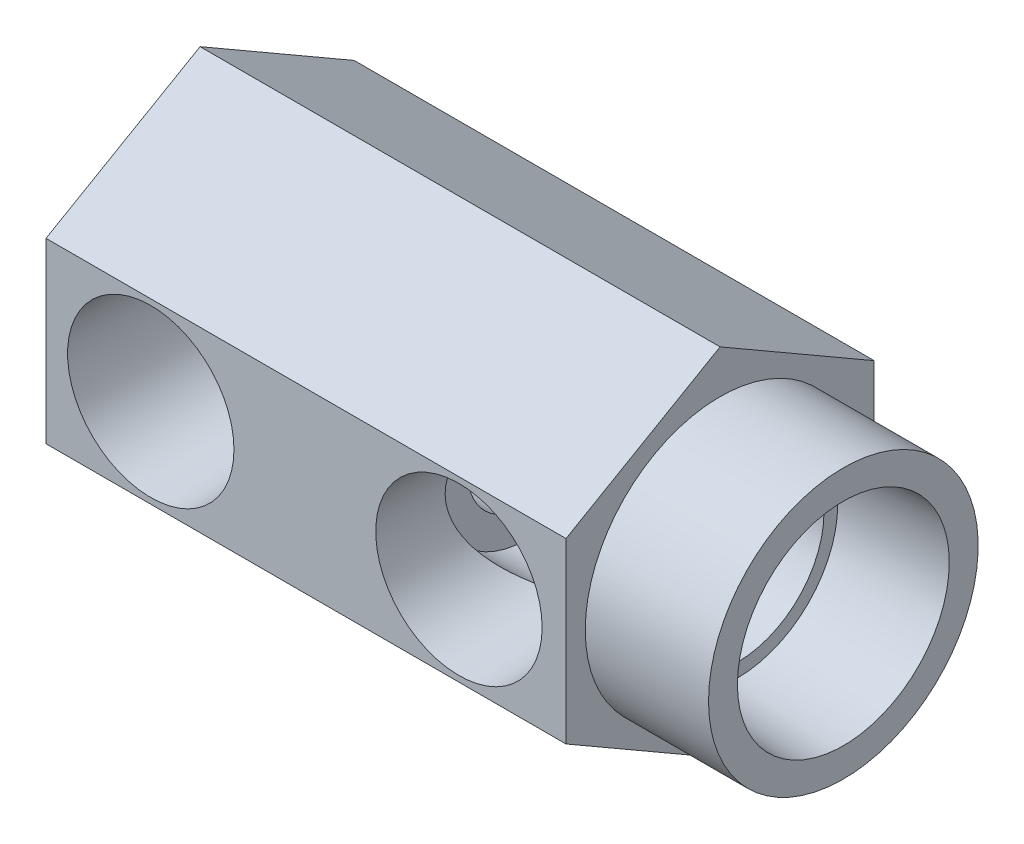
ISO-10303-21;
HEADER;
FILE_DESCRIPTION(('STEP AP214'),'2;1');
FILE_NAME('part.step','',(''),(''),'','','');
FILE_SCHEMA(('AUTOMOTIVE_DESIGN { 1 0 10303 214 1 1 1 1 }'));
ENDSEC;
DATA;
#1=APPLICATION_CONTEXT('core data for automotive mechanical design processes');
#2=APPLICATION_PROTOCOL_DEFINITION('international standard','automotive_design',2000,#1);
#3=PRODUCT_CONTEXT('',#1,'mechanical');
#4=PRODUCT('Part','Part','',(#3));
#5=PRODUCT_RELATED_PRODUCT_CATEGORY('part','',(#4));
#6=PRODUCT_DEFINITION_FORMATION('','',#4);
#7=PRODUCT_DEFINITION_CONTEXT('part definition',#1,'design');
#8=PRODUCT_DEFINITION('design','',#6,#7);
#9=PRODUCT_DEFINITION_SHAPE('','',#8);
#10=(LENGTH_UNIT() NAMED_UNIT(*) SI_UNIT(.MILLI.,.METRE.));
#11=(NAMED_UNIT(*) PLANE_ANGLE_UNIT() SI_UNIT($,.RADIAN.));
#12=(NAMED_UNIT(*) SI_UNIT($,.STERADIAN.) SOLID_ANGLE_UNIT());
#13=UNCERTAINTY_MEASURE_WITH_UNIT(LENGTH_MEASURE(1.E-05),#10,'distance_accuracy_value','');
#14=(GEOMETRIC_REPRESENTATION_CONTEXT(3) GLOBAL_UNCERTAINTY_ASSIGNED_CONTEXT((#13)) GLOBAL_UNIT_ASSIGNED_CONTEXT((#10,
#11,#12)) REPRESENTATION_CONTEXT('',''));
#15=CARTESIAN_POINT('',(0.,0.,0.));
#16=DIRECTION('',(0.,0.,1.));
#17=DIRECTION('',(1.,0.,0.));
#18=AXIS2_PLACEMENT_3D('',#15,#16,#17);
#19=CARTESIAN_POINT('',(53.0225,0.,0.));
#20=DIRECTION('',(-1.,0.,0.));
#21=DIRECTION('',(0.,0.,1.));
#22=AXIS2_PLACEMENT_3D('',#19,#20,#21);
#23=PLANE('',#22);
#24=CARTESIAN_POINT('',(53.0225,0.,0.));
#25=DIRECTION('',(-1.,0.,0.));
#26=DIRECTION('',(0.,0.,1.));
#27=AXIS2_PLACEMENT_3D('',#24,#25,#26);
#28=CIRCLE('',#27,11.1125);
#29=CARTESIAN_POINT('',(53.0225,0.,11.1125));
#30=VERTEX_POINT('',#29);
#31=EDGE_CURVE('E136',#30,#30,#28,.T.);
#32=ORIENTED_EDGE('',*,*,#31,.F.);
#33=EDGE_LOOP('',(#32));
#34=FACE_BOUND('',#33,.T.);
#35=CARTESIAN_POINT('',(53.0225,0.,0.));
#36=DIRECTION('',(-1.,0.,0.));
#37=DIRECTION('',(0.,0.,1.));
#38=AXIS2_PLACEMENT_3D('',#35,#36,#37);
#39=CIRCLE('',#38,8.73125);
#40=CARTESIAN_POINT('',(53.0225,0.,8.73125));
#41=VERTEX_POINT('',#40);
#42=EDGE_CURVE('E162',#41,#41,#39,.T.);
#43=ORIENTED_EDGE('',*,*,#42,.T.);
#44=EDGE_LOOP('',(#43));
#45=FACE_BOUND('',#44,.T.);
#46=ADVANCED_FACE('F34',(#34,#45),#23,.F.);
#47=CARTESIAN_POINT('',(42.8625,-7.33234841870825,-12.7));
#48=DIRECTION('',(0.,0.,1.));
#49=DIRECTION('',(0.,-1.,0.));
#50=AXIS2_PLACEMENT_3D('',#47,#48,#49);
#51=PLANE('',#50);
#52=CARTESIAN_POINT('',(8.636,0.,-12.7));
#53=DIRECTION('',(0.,0.,-1.));
#54=DIRECTION('',(0.,1.,0.));
#55=AXIS2_PLACEMENT_3D('',#52,#53,#54);
#56=CIRCLE('',#55,6.858);
#57=CARTESIAN_POINT('',(8.636,6.858,-12.7));
#58=VERTEX_POINT('',#57);
#59=EDGE_CURVE('E269',#58,#58,#56,.T.);
#60=ORIENTED_EDGE('',*,*,#59,.F.);
#61=EDGE_LOOP('',(#60));
#62=FACE_BOUND('',#61,.T.);
#63=DIRECTION('',(0.,1.,0.));
#64=VECTOR('',#63,1.);
#65=CARTESIAN_POINT('',(0.,-7.33234841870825,-12.7));
#66=LINE('',#65,#64);
#67=CARTESIAN_POINT('',(0.,-7.33234841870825,-12.7));
#68=VERTEX_POINT('',#67);
#69=CARTESIAN_POINT('',(0.,7.33234841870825,-12.7));
#70=VERTEX_POINT('',#69);
#71=EDGE_CURVE('E132',#68,#70,#66,.T.);
#72=ORIENTED_EDGE('',*,*,#71,.T.);
#73=DIRECTION('',(-1.,0.,0.));
#74=VECTOR('',#73,1.);
#75=CARTESIAN_POINT('',(42.8625,7.33234841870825,-12.7));
#76=LINE('',#75,#74);
#77=CARTESIAN_POINT('',(42.8625,7.33234841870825,-12.7));
#78=VERTEX_POINT('',#77);
#79=EDGE_CURVE('E151',#78,#70,#76,.T.);
#80=ORIENTED_EDGE('',*,*,#79,.F.);
#81=DIRECTION('',(0.,1.,0.));
#82=VECTOR('',#81,1.);
#83=CARTESIAN_POINT('',(42.8625,-7.33234841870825,-12.7));
#84=LINE('',#83,#82);
#85=CARTESIAN_POINT('',(42.8625,-7.33234841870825,-12.7));
#86=VERTEX_POINT('',#85);
#87=EDGE_CURVE('E144',#86,#78,#84,.T.);
#88=ORIENTED_EDGE('',*,*,#87,.F.);
#89=DIRECTION('',(-1.,0.,0.));
#90=VECTOR('',#89,1.);
#91=CARTESIAN_POINT('',(42.8625,-7.33234841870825,-12.7));
#92=LINE('',#91,#90);
#93=EDGE_CURVE('E128',#86,#68,#92,.T.);
#94=ORIENTED_EDGE('',*,*,#93,.T.);
#95=EDGE_LOOP('',(#72,#80,#88,#94));
#96=FACE_BOUND('',#95,.T.);
#97=ADVANCED_FACE('F36',(#62,#96),#51,.F.);
#98=CARTESIAN_POINT('',(42.8625,7.33234841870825,-12.7));
#99=DIRECTION('',(0.,-0.866025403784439,0.5));
#100=DIRECTION('',(0.,-0.5,-0.866025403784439));
#101=AXIS2_PLACEMENT_3D('',#98,#99,#100);
#102=PLANE('',#101);
#103=DIRECTION('',(0.,0.5,0.866025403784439));
#104=VECTOR('',#103,1.);
#105=CARTESIAN_POINT('',(0.,7.33234841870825,-12.7));
#106=LINE('',#105,#104);
#107=CARTESIAN_POINT('',(0.,14.6646968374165,0.));
#108=VERTEX_POINT('',#107);
#109=EDGE_CURVE('E135',#70,#108,#106,.T.);
#110=ORIENTED_EDGE('',*,*,#109,.T.);
#111=DIRECTION('',(-1.,0.,0.));
#112=VECTOR('',#111,1.);
#113=CARTESIAN_POINT('',(42.8625,14.6646968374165,0.));
#114=LINE('',#113,#112);
#115=CARTESIAN_POINT('',(42.8625,14.6646968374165,0.));
#116=VERTEX_POINT('',#115);
#117=EDGE_CURVE('E148',#116,#108,#114,.T.);
#118=ORIENTED_EDGE('',*,*,#117,.F.);
#119=DIRECTION('',(0.,0.5,0.866025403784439));
#120=VECTOR('',#119,1.);
#121=CARTESIAN_POINT('',(42.8625,7.33234841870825,-12.7));
#122=LINE('',#121,#120);
#123=EDGE_CURVE('E95',#78,#116,#122,.T.);
#124=ORIENTED_EDGE('',*,*,#123,.F.);
#125=ORIENTED_EDGE('',*,*,#79,.T.);
#126=EDGE_LOOP('',(#110,#118,#124,#125));
#127=FACE_BOUND('',#126,.T.);
#128=ADVANCED_FACE('F197',(#127),#102,.F.);
#129=CARTESIAN_POINT('',(42.8625,14.6646968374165,0.));
#130=DIRECTION('',(0.,-0.866025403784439,-0.5));
#131=DIRECTION('',(0.,0.5,-0.866025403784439));
#132=AXIS2_PLACEMENT_3D('',#129,#130,#131);
#133=PLANE('',#132);
#134=DIRECTION('',(0.,-0.5,0.866025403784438));
#135=VECTOR('',#134,1.);
#136=CARTESIAN_POINT('',(0.,14.6646968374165,0.));
#137=LINE('',#136,#135);
#138=CARTESIAN_POINT('',(0.,7.33234841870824,12.7));
#139=VERTEX_POINT('',#138);
#140=EDGE_CURVE('E138',#108,#139,#137,.T.);
#141=ORIENTED_EDGE('',*,*,#140,.T.);
#142=DIRECTION('',(-1.,0.,0.));
#143=VECTOR('',#142,1.);
#144=CARTESIAN_POINT('',(42.8625,7.33234841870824,12.7));
#145=LINE('',#144,#143);
#146=CARTESIAN_POINT('',(42.8625,7.33234841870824,12.7));
#147=VERTEX_POINT('',#146);
#148=EDGE_CURVE('E123',#147,#139,#145,.T.);
#149=ORIENTED_EDGE('',*,*,#148,.F.);
#150=DIRECTION('',(0.,-0.5,0.866025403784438));
#151=VECTOR('',#150,1.);
#152=CARTESIAN_POINT('',(42.8625,14.6646968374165,0.));
#153=LINE('',#152,#151);
#154=EDGE_CURVE('E111',#116,#147,#153,.T.);
#155=ORIENTED_EDGE('',*,*,#154,.F.);
#156=ORIENTED_EDGE('',*,*,#117,.T.);
#157=EDGE_LOOP('',(#141,#149,#155,#156));
#158=FACE_BOUND('',#157,.T.);
#159=ADVANCED_FACE('F222',(#158),#133,.F.);
#160=CARTESIAN_POINT('',(42.8625,7.33234841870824,12.7));
#161=DIRECTION('',(0.,0.,-1.));
#162=DIRECTION('',(-1.,0.,0.));
#163=AXIS2_PLACEMENT_3D('',#160,#161,#162);
#164=PLANE('',#163);
#165=CARTESIAN_POINT('',(8.636,0.,12.7));
#166=DIRECTION('',(0.,0.,1.));
#167=DIRECTION('',(1.,0.,0.));
#168=AXIS2_PLACEMENT_3D('',#165,#166,#167);
#169=CIRCLE('',#168,6.858);
#170=CARTESIAN_POINT('',(15.494,0.,12.7));
#171=VERTEX_POINT('',#170);
#172=EDGE_CURVE('E260',#171,#171,#169,.T.);
#173=ORIENTED_EDGE('',*,*,#172,.F.);
#174=EDGE_LOOP('',(#173));
#175=FACE_BOUND('',#174,.T.);
#176=CARTESIAN_POINT('',(34.036,0.,12.7));
#177=DIRECTION('',(0.,0.,1.));
#178=DIRECTION('',(1.,0.,0.));
#179=AXIS2_PLACEMENT_3D('',#176,#177,#178);
#180=CIRCLE('',#179,6.858);
#181=CARTESIAN_POINT('',(40.894,0.,12.7));
#182=VERTEX_POINT('',#181);
#183=EDGE_CURVE('E163',#182,#182,#180,.T.);
#184=ORIENTED_EDGE('',*,*,#183,.F.);
#185=EDGE_LOOP('',(#184));
#186=FACE_BOUND('',#185,.T.);
#187=DIRECTION('',(0.,-1.,0.));
#188=VECTOR('',#187,1.);
#189=CARTESIAN_POINT('',(0.,7.33234841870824,12.7));
#190=LINE('',#189,#188);
#191=CARTESIAN_POINT('',(0.,-7.33234841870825,12.7));
#192=VERTEX_POINT('',#191);
#193=EDGE_CURVE('E120',#139,#192,#190,.T.);
#194=ORIENTED_EDGE('',*,*,#193,.T.);
#195=DIRECTION('',(-1.,0.,0.));
#196=VECTOR('',#195,1.);
#197=CARTESIAN_POINT('',(42.8625,-7.33234841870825,12.7));
#198=LINE('',#197,#196);
#199=CARTESIAN_POINT('',(42.8625,-7.33234841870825,12.7));
#200=VERTEX_POINT('',#199);
#201=EDGE_CURVE('E117',#200,#192,#198,.T.);
#202=ORIENTED_EDGE('',*,*,#201,.F.);
#203=DIRECTION('',(0.,-1.,0.));
#204=VECTOR('',#203,1.);
#205=CARTESIAN_POINT('',(42.8625,7.33234841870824,12.7));
#206=LINE('',#205,#204);
#207=EDGE_CURVE('E104',#147,#200,#206,.T.);
#208=ORIENTED_EDGE('',*,*,#207,.F.);
#209=ORIENTED_EDGE('',*,*,#148,.T.);
#210=EDGE_LOOP('',(#194,#202,#208,#209));
#211=FACE_BOUND('',#210,.T.);
#212=ADVANCED_FACE('F118',(#175,#186,#211),#164,.F.);
#213=CARTESIAN_POINT('',(42.8625,-7.33234841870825,12.7));
#214=DIRECTION('',(0.,0.866025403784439,-0.5));
#215=DIRECTION('',(0.,0.5,0.866025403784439));
#216=AXIS2_PLACEMENT_3D('',#213,#214,#215);
#217=PLANE('',#216);
#218=DIRECTION('',(0.,-0.5,-0.866025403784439));
#219=VECTOR('',#218,1.);
#220=CARTESIAN_POINT('',(0.,-7.33234841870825,12.7));
#221=LINE('',#220,#219);
#222=CARTESIAN_POINT('',(0.,-14.6646968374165,0.));
#223=VERTEX_POINT('',#222);
#224=EDGE_CURVE('E141',#192,#223,#221,.T.);
#225=ORIENTED_EDGE('',*,*,#224,.T.);
#226=DIRECTION('',(-1.,0.,0.));
#227=VECTOR('',#226,1.);
#228=CARTESIAN_POINT('',(42.8625,-14.6646968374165,0.));
#229=LINE('',#228,#227);
#230=CARTESIAN_POINT('',(42.8625,-14.6646968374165,0.));
#231=VERTEX_POINT('',#230);
#232=EDGE_CURVE('E124',#231,#223,#229,.T.);
#233=ORIENTED_EDGE('',*,*,#232,.F.);
#234=DIRECTION('',(0.,-0.5,-0.866025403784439));
#235=VECTOR('',#234,1.);
#236=CARTESIAN_POINT('',(42.8625,-7.33234841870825,12.7));
#237=LINE('',#236,#235);
#238=EDGE_CURVE('E108',#200,#231,#237,.T.);
#239=ORIENTED_EDGE('',*,*,#238,.F.);
#240=ORIENTED_EDGE('',*,*,#201,.T.);
#241=EDGE_LOOP('',(#225,#233,#239,#240));
#242=FACE_BOUND('',#241,.T.);
#243=ADVANCED_FACE('F126',(#242),#217,.F.);
#244=CARTESIAN_POINT('',(42.8625,-14.6646968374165,0.));
#245=DIRECTION('',(0.,0.866025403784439,0.5));
#246=DIRECTION('',(0.,-0.5,0.866025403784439));
#247=AXIS2_PLACEMENT_3D('',#244,#245,#246);
#248=PLANE('',#247);
#249=DIRECTION('',(0.,0.5,-0.866025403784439));
#250=VECTOR('',#249,1.);
#251=CARTESIAN_POINT('',(0.,-14.6646968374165,0.));
#252=LINE('',#251,#250);
#253=EDGE_CURVE('E86',#223,#68,#252,.T.);
#254=ORIENTED_EDGE('',*,*,#253,.T.);
#255=ORIENTED_EDGE('',*,*,#93,.F.);
#256=DIRECTION('',(0.,0.5,-0.866025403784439));
#257=VECTOR('',#256,1.);
#258=CARTESIAN_POINT('',(42.8625,-14.6646968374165,0.));
#259=LINE('',#258,#257);
#260=EDGE_CURVE('E59',#231,#86,#259,.T.);
#261=ORIENTED_EDGE('',*,*,#260,.F.);
#262=ORIENTED_EDGE('',*,*,#232,.T.);
#263=EDGE_LOOP('',(#254,#255,#261,#262));
#264=FACE_BOUND('',#263,.T.);
#265=ADVANCED_FACE('F211',(#264),#248,.F.);
#266=CARTESIAN_POINT('',(42.8625,7.33234841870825,-12.7));
#267=DIRECTION('',(1.,0.,0.));
#268=DIRECTION('',(0.,0.,-1.));
#269=AXIS2_PLACEMENT_3D('',#266,#267,#268);
#270=PLANE('',#269);
#271=CARTESIAN_POINT('',(42.8625,0.,0.));
#272=DIRECTION('',(1.,0.,0.));
#273=DIRECTION('',(0.,0.,-1.));
#274=AXIS2_PLACEMENT_3D('',#271,#272,#273);
#275=CIRCLE('',#274,11.1125);
#276=CARTESIAN_POINT('',(42.8625,0.,11.1125));
#277=VERTEX_POINT('',#276);
#278=EDGE_CURVE('E153',#277,#277,#275,.T.);
#279=ORIENTED_EDGE('',*,*,#278,.F.);
#280=EDGE_LOOP('',(#279));
#281=FACE_BOUND('',#280,.T.);
#282=ORIENTED_EDGE('',*,*,#87,.T.);
#283=ORIENTED_EDGE('',*,*,#123,.T.);
#284=ORIENTED_EDGE('',*,*,#154,.T.);
#285=ORIENTED_EDGE('',*,*,#207,.T.);
#286=ORIENTED_EDGE('',*,*,#238,.T.);
#287=ORIENTED_EDGE('',*,*,#260,.T.);
#288=EDGE_LOOP('',(#282,#283,#284,#285,#286,#287));
#289=FACE_BOUND('',#288,.T.);
#290=ADVANCED_FACE('F106',(#281,#289),#270,.T.);
#291=CARTESIAN_POINT('',(0.,7.33234841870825,-12.7));
#292=DIRECTION('',(1.,0.,0.));
#293=DIRECTION('',(0.,0.,-1.));
#294=AXIS2_PLACEMENT_3D('',#291,#292,#293);
#295=PLANE('',#294);
#296=ORIENTED_EDGE('',*,*,#71,.F.);
#297=ORIENTED_EDGE('',*,*,#253,.F.);
#298=ORIENTED_EDGE('',*,*,#224,.F.);
#299=ORIENTED_EDGE('',*,*,#193,.F.);
#300=ORIENTED_EDGE('',*,*,#140,.F.);
#301=ORIENTED_EDGE('',*,*,#109,.F.);
#302=EDGE_LOOP('',(#296,#297,#298,#299,#300,#301));
#303=FACE_BOUND('',#302,.T.);
#304=ADVANCED_FACE('F207',(#303),#295,.F.);
#305=CARTESIAN_POINT('',(53.0225,0.,0.));
#306=DIRECTION('',(-1.,0.,0.));
#307=DIRECTION('',(0.,0.,1.));
#308=AXIS2_PLACEMENT_3D('',#305,#306,#307);
#309=CYLINDRICAL_SURFACE('',#308,11.1125);
#310=CARTESIAN_POINT('',(42.8625,0.,11.1125));
#311=CARTESIAN_POINT('',(42.9683333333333,0.,11.1125));
#312=CARTESIAN_POINT('',(43.0741666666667,0.,11.1125));
#313=CARTESIAN_POINT('',(43.2858333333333,0.,11.1125));
#314=CARTESIAN_POINT('',(43.3916666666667,0.,11.1125));
#315=CARTESIAN_POINT('',(43.6033333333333,0.,11.1125));
#316=CARTESIAN_POINT('',(43.7091666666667,0.,11.1125));
#317=CARTESIAN_POINT('',(43.9208333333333,0.,11.1125));
#318=CARTESIAN_POINT('',(44.0266666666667,0.,11.1125));
#319=CARTESIAN_POINT('',(44.2383333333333,0.,11.1125));
#320=CARTESIAN_POINT('',(44.3441666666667,0.,11.1125));
#321=CARTESIAN_POINT('',(44.5558333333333,0.,11.1125));
#322=CARTESIAN_POINT('',(44.6616666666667,0.,11.1125));
#323=CARTESIAN_POINT('',(44.8733333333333,0.,11.1125));
#324=CARTESIAN_POINT('',(44.9791666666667,0.,11.1125));
#325=CARTESIAN_POINT('',(45.1908333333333,0.,11.1125));
#326=CARTESIAN_POINT('',(45.2966666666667,0.,11.1125));
#327=CARTESIAN_POINT('',(45.5083333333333,0.,11.1125));
#328=CARTESIAN_POINT('',(45.6141666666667,0.,11.1125));
#329=CARTESIAN_POINT('',(45.8258333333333,0.,11.1125));
#330=CARTESIAN_POINT('',(45.9316666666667,0.,11.1125));
#331=CARTESIAN_POINT('',(46.1433333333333,0.,11.1125));
#332=CARTESIAN_POINT('',(46.2491666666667,0.,11.1125));
#333=CARTESIAN_POINT('',(46.4608333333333,0.,11.1125));
#334=CARTESIAN_POINT('',(46.5666666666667,0.,11.1125));
#335=CARTESIAN_POINT('',(46.7783333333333,0.,11.1125));
#336=CARTESIAN_POINT('',(46.8841666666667,0.,11.1125));
#337=CARTESIAN_POINT('',(47.0958333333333,0.,11.1125));
#338=CARTESIAN_POINT('',(47.2016666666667,0.,11.1125));
#339=CARTESIAN_POINT('',(47.4133333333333,0.,11.1125));
#340=CARTESIAN_POINT('',(47.5191666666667,0.,11.1125));
#341=CARTESIAN_POINT('',(47.7308333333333,0.,11.1125));
#342=CARTESIAN_POINT('',(47.8366666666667,0.,11.1125));
#343=CARTESIAN_POINT('',(48.0483333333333,0.,11.1125));
#344=CARTESIAN_POINT('',(48.1541666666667,0.,11.1125));
#345=CARTESIAN_POINT('',(48.3658333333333,0.,11.1125));
#346=CARTESIAN_POINT('',(48.4716666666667,0.,11.1125));
#347=CARTESIAN_POINT('',(48.6833333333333,0.,11.1125));
#348=CARTESIAN_POINT('',(48.7891666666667,0.,11.1125));
#349=CARTESIAN_POINT('',(49.0008333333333,0.,11.1125));
#350=CARTESIAN_POINT('',(49.1066666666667,0.,11.1125));
#351=CARTESIAN_POINT('',(49.3183333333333,0.,11.1125));
#352=CARTESIAN_POINT('',(49.4241666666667,0.,11.1125));
#353=CARTESIAN_POINT('',(49.6358333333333,0.,11.1125));
#354=CARTESIAN_POINT('',(49.7416666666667,0.,11.1125));
#355=CARTESIAN_POINT('',(49.9533333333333,0.,11.1125));
#356=CARTESIAN_POINT('',(50.0591666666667,0.,11.1125));
#357=CARTESIAN_POINT('',(50.2708333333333,0.,11.1125));
#358=CARTESIAN_POINT('',(50.3766666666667,0.,11.1125));
#359=CARTESIAN_POINT('',(50.5883333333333,0.,11.1125));
#360=CARTESIAN_POINT('',(50.6941666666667,0.,11.1125));
#361=CARTESIAN_POINT('',(50.9058333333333,0.,11.1125));
#362=CARTESIAN_POINT('',(51.0116666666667,0.,11.1125));
#363=CARTESIAN_POINT('',(51.2233333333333,0.,11.1125));
#364=CARTESIAN_POINT('',(51.3291666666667,0.,11.1125));
#365=CARTESIAN_POINT('',(51.5408333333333,0.,11.1125));
#366=CARTESIAN_POINT('',(51.6466666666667,0.,11.1125));
#367=CARTESIAN_POINT('',(51.8583333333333,0.,11.1125));
#368=CARTESIAN_POINT('',(51.9641666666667,0.,11.1125));
#369=CARTESIAN_POINT('',(52.1758333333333,0.,11.1125));
#370=CARTESIAN_POINT('',(52.2816666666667,0.,11.1125));
#371=CARTESIAN_POINT('',(52.4933333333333,0.,11.1125));
#372=CARTESIAN_POINT('',(52.5991666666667,0.,11.1125));
#373=CARTESIAN_POINT('',(52.8108333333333,0.,11.1125));
#374=CARTESIAN_POINT('',(52.9166666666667,0.,11.1125));
#375=CARTESIAN_POINT('',(53.0225,0.,11.1125));
#376=B_SPLINE_CURVE_WITH_KNOTS('',3,(#310,#311,#312,#313,#314,#315,#316,#317,#318,#319,#320,
#321,#322,#323,#324,#325,#326,#327,#328,#329,#330,#331,#332,#333,#334,#335,#336,#337,#338,#339,
#340,#341,#342,#343,#344,#345,#346,#347,#348,#349,#350,#351,#352,#353,#354,#355,#356,#357,#358,
#359,#360,#361,#362,#363,#364,#365,#366,#367,#368,#369,#370,#371,#372,#373,#374,#375),
.UNSPECIFIED.,.F.,.F.,(4,2,2,2,2,2,2,2,2,2,2,2,2,2,2,2,2,2,2,2,2,2,2,2,2,2,2,2,2,2,2,2,4),(0.,
0.317500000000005,0.635000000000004,0.952500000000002,1.27,1.5875,1.905,2.2225,2.54,
2.85750000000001,3.175,3.4925,3.81,4.12750000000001,4.445,4.7625,5.08,5.39750000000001,
5.71500000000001,6.0325,6.35,6.66750000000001,6.985,7.3025,7.62,7.93750000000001,
8.25500000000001,8.5725,8.89000000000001,9.20750000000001,9.52500000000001,9.8425,10.16),.UNSPECIFIED.);
#377=EDGE_CURVE('BSEAM204',#277,#30,#376,.T.);
#378=ORIENTED_EDGE('',*,*,#278,.T.);
#379=ORIENTED_EDGE('',*,*,#31,.T.);
#380=ORIENTED_EDGE('',*,*,#377,.T.);
#381=ORIENTED_EDGE('',*,*,#377,.F.);
#382=EDGE_LOOP('',(#378,#380,#379,#381));
#383=FACE_BOUND('',#382,.T.);
#384=ADVANCED_FACE('F204',(#383),#309,.T.);
#385=CARTESIAN_POINT('',(53.0225,0.,0.));
#386=DIRECTION('',(1.,0.,0.));
#387=DIRECTION('',(0.,0.,-1.));
#388=AXIS2_PLACEMENT_3D('',#385,#386,#387);
#389=CONICAL_SURFACE('',#388,8.73125,0.0523598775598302);
#390=CARTESIAN_POINT('',(44.2849,0.,0.));
#391=DIRECTION('',(-1.,0.,0.));
#392=DIRECTION('',(0.,0.,1.));
#393=AXIS2_PLACEMENT_3D('',#390,#391,#392);
#394=CIRCLE('',#393,8.2733317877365);
#395=CARTESIAN_POINT('',(44.2849,0.,8.2733317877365));
#396=VERTEX_POINT('',#395);
#397=EDGE_CURVE('E241',#396,#396,#394,.T.);
#398=ORIENTED_EDGE('',*,*,#397,.T.);
#399=EDGE_LOOP('',(#398));
#400=FACE_BOUND('',#399,.T.);
#401=ORIENTED_EDGE('',*,*,#42,.F.);
#402=EDGE_LOOP('',(#401));
#403=FACE_BOUND('',#402,.T.);
#404=ADVANCED_FACE('F203',(#400,#403),#389,.F.);
#405=CARTESIAN_POINT('',(44.2849,0.,-7.14375));
#406=DIRECTION('',(1.,0.,0.));
#407=DIRECTION('',(0.,0.,-1.));
#408=AXIS2_PLACEMENT_3D('',#405,#406,#407);
#409=PLANE('',#408);
#410=CARTESIAN_POINT('',(44.2849,0.,0.));
#411=DIRECTION('',(-1.,0.,0.));
#412=DIRECTION('',(0.,0.,1.));
#413=AXIS2_PLACEMENT_3D('',#410,#411,#412);
#414=CIRCLE('',#413,7.14375);
#415=CARTESIAN_POINT('',(44.2849,0.,7.14375));
#416=VERTEX_POINT('',#415);
#417=EDGE_CURVE('E244',#416,#416,#414,.T.);
#418=ORIENTED_EDGE('',*,*,#417,.T.);
#419=EDGE_LOOP('',(#418));
#420=FACE_BOUND('',#419,.T.);
#421=ORIENTED_EDGE('',*,*,#397,.F.);
#422=EDGE_LOOP('',(#421));
#423=FACE_BOUND('',#422,.T.);
#424=ADVANCED_FACE('F187',(#420,#423),#409,.T.);
#425=CARTESIAN_POINT('',(0.,0.,0.));
#426=DIRECTION('',(-1.,0.,0.));
#427=DIRECTION('',(0.,0.,1.));
#428=AXIS2_PLACEMENT_3D('',#425,#426,#427);
#429=CYLINDRICAL_SURFACE('',#428,7.14375);
#430=CARTESIAN_POINT('',(29.5083238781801,-4.84980912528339,5.24523766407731));
#431=CARTESIAN_POINT('',(29.3823544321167,-4.73649479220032,5.35000911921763));
#432=CARTESIAN_POINT('',(29.2599964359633,-4.61761883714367,5.45310749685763));
#433=CARTESIAN_POINT('',(29.0231642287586,-4.36856062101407,5.65460311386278));
#434=CARTESIAN_POINT('',(28.9086917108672,-4.2383759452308,5.75299934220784));
#435=CARTESIAN_POINT('',(28.5788727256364,-3.83115643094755,6.03862646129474));
#436=CARTESIAN_POINT('',(28.3763742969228,-3.5367918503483,6.21692838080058));
#437=CARTESIAN_POINT('',(28.0538983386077,-2.96968952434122,6.50328768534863));
#438=CARTESIAN_POINT('',(27.9255188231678,-2.70526788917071,6.61823869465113));
#439=CARTESIAN_POINT('',(27.7586939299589,-2.29028648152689,6.76826870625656));
#440=CARTESIAN_POINT('',(27.7073630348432,-2.14884896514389,6.8145581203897));
#441=CARTESIAN_POINT('',(27.6140676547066,-1.86054994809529,6.89884323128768));
#442=CARTESIAN_POINT('',(27.5720989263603,-1.71369093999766,6.93684268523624));
#443=CARTESIAN_POINT('',(27.4979485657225,-1.414195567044,7.00406775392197));
#444=CARTESIAN_POINT('',(27.4658506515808,-1.26152149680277,7.03321829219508));
#445=CARTESIAN_POINT('',(27.4125567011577,-0.952726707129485,7.08165900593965));
#446=CARTESIAN_POINT('',(27.3913607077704,-0.796605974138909,7.10094914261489));
#447=CARTESIAN_POINT('',(27.3603434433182,-0.482397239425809,7.12918813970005));
#448=CARTESIAN_POINT('',(27.3505155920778,-0.324310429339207,7.13814298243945));
#449=CARTESIAN_POINT('',(27.3424395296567,-0.00760472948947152,7.14550111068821));
#450=CARTESIAN_POINT('',(27.3441899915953,0.151014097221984,7.14390560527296));
#451=CARTESIAN_POINT('',(27.3582642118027,0.447084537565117,7.13108429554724));
#452=CARTESIAN_POINT('',(27.3692131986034,0.584659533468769,7.12111067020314));
#453=CARTESIAN_POINT('',(27.3997039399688,0.858102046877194,7.09335714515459));
#454=CARTESIAN_POINT('',(27.4192484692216,0.993968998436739,7.07557472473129));
#455=CARTESIAN_POINT('',(27.466605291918,1.26299966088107,7.03253460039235));
#456=CARTESIAN_POINT('',(27.4944148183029,1.39616426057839,7.00727939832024));
#457=CARTESIAN_POINT('',(27.5578761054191,1.65907882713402,6.94973123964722));
#458=CARTESIAN_POINT('',(27.5935308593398,1.78882746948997,6.91743559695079));
#459=CARTESIAN_POINT('',(27.7129858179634,2.17658998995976,6.80942962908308));
#460=CARTESIAN_POINT('',(27.8084072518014,2.42828613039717,6.72339475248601));
#461=CARTESIAN_POINT('',(28.0252282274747,2.91081077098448,6.52902769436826));
#462=CARTESIAN_POINT('',(28.1466402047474,3.14162920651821,6.4206848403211));
#463=CARTESIAN_POINT('',(28.3782585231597,3.52618432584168,6.21564053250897));
#464=CARTESIAN_POINT('',(28.4837716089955,3.68483726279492,6.12271976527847));
#465=CARTESIAN_POINT('',(28.7055260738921,3.98924030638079,5.92888551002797));
#466=CARTESIAN_POINT('',(28.8217685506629,4.13498908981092,5.82797120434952));
#467=CARTESIAN_POINT('',(29.0639877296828,4.4139197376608,5.61968420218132));
#468=CARTESIAN_POINT('',(29.1899871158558,4.54707061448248,5.51229659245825));
#469=CARTESIAN_POINT('',(29.4505015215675,4.80059283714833,5.29297268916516));
#470=CARTESIAN_POINT('',(29.5850153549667,4.92096595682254,5.18103702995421));
#471=CARTESIAN_POINT('',(29.8652504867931,5.15193999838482,4.95154587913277));
#472=CARTESIAN_POINT('',(30.0111628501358,5.26223846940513,4.83392000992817));
#473=CARTESIAN_POINT('',(30.3109913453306,5.47001778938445,4.5974813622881));
#474=CARTESIAN_POINT('',(30.4649093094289,5.56749568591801,4.47866831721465));
#475=CARTESIAN_POINT('',(30.7805694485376,5.74962950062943,4.24230260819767));
#476=CARTESIAN_POINT('',(30.9422973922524,5.83430765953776,4.12474809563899));
#477=CARTESIAN_POINT('',(31.2743883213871,5.99102033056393,3.8936229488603));
#478=CARTESIAN_POINT('',(31.4447466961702,6.06306150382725,3.7800502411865));
#479=CARTESIAN_POINT('',(31.7978500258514,6.19515862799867,3.55947956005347));
#480=CARTESIAN_POINT('',(31.9807328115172,6.25503666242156,3.45259311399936));
#481=CARTESIAN_POINT('',(32.358632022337,6.36064590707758,3.25391190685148));
#482=CARTESIAN_POINT('',(32.5536444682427,6.40638172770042,3.1621122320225));
#483=CARTESIAN_POINT('',(32.9222061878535,6.47520032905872,3.01831607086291));
#484=CARTESIAN_POINT('',(33.0935699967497,6.50084233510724,2.9621704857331));
#485=CARTESIAN_POINT('',(33.3562389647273,6.52980353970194,2.89747888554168));
#486=CARTESIAN_POINT('',(33.4446376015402,6.53787016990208,2.87917840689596));
#487=CARTESIAN_POINT('',(33.6228631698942,6.55066806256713,2.84994222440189));
#488=CARTESIAN_POINT('',(33.7126893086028,6.55540111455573,2.83900256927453));
#489=CARTESIAN_POINT('',(33.8939412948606,6.56142550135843,2.82505214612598));
#490=CARTESIAN_POINT('',(33.9853742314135,6.56268366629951,2.82211779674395));
#491=CARTESIAN_POINT('',(34.1681034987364,6.56162318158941,2.82458265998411));
#492=CARTESIAN_POINT('',(34.2593998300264,6.55930454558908,2.82998184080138));
#493=CARTESIAN_POINT('',(34.4411485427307,6.55115703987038,2.84879031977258));
#494=CARTESIAN_POINT('',(34.5315992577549,6.54532230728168,2.86221299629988));
#495=CARTESIAN_POINT('',(34.7108593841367,6.53030374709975,2.89631629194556));
#496=CARTESIAN_POINT('',(34.7996676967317,6.52111775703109,2.91700159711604));
#497=CARTESIAN_POINT('',(35.1206850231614,6.48175953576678,3.00411504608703));
#498=CARTESIAN_POINT('',(35.3466817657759,6.44203402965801,3.08954587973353));
#499=CARTESIAN_POINT('',(35.6732857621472,6.36852534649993,3.23699418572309));
#500=CARTESIAN_POINT('',(35.7803260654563,6.34162243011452,3.28950733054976));
#501=CARTESIAN_POINT('',(35.9906747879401,6.28341303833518,3.3993741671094));
#502=CARTESIAN_POINT('',(36.0939843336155,6.25210790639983,3.45672637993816));
#503=CARTESIAN_POINT('',(36.3931128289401,6.15375523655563,3.63067422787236));
#504=CARTESIAN_POINT('',(36.5841984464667,6.08086385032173,3.7520873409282));
#505=CARTESIAN_POINT('',(36.9555584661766,5.91986154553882,4.00131490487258));
#506=CARTESIAN_POINT('',(37.1358239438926,5.83173828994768,4.12913448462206));
#507=CARTESIAN_POINT('',(37.4867903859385,5.64023525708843,4.38711347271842));
#508=CARTESIAN_POINT('',(37.6574766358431,5.53683284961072,4.51727609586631));
#509=CARTESIAN_POINT('',(37.9892506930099,5.3147090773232,4.77663018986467));
#510=CARTESIAN_POINT('',(38.1503414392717,5.19599243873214,4.90582194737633));
#511=CARTESIAN_POINT('',(38.4717958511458,4.93546969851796,5.16821607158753));
#512=CARTESIAN_POINT('',(38.6315672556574,4.79271987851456,5.3012118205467));
#513=CARTESIAN_POINT('',(38.9390566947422,4.48916243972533,5.56061661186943));
#514=CARTESIAN_POINT('',(39.0867710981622,4.32834941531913,5.6870236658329));
#515=CARTESIAN_POINT('',(39.3678859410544,3.98902350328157,5.92994514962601));
#516=CARTESIAN_POINT('',(39.5013354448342,3.81057563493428,6.04649318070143));
#517=CARTESIAN_POINT('',(39.752163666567,3.43564684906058,6.26711376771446));
#518=CARTESIAN_POINT('',(39.8695553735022,3.2391807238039,6.37119639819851));
#519=CARTESIAN_POINT('',(40.043053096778,2.90961722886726,6.52581221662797));
#520=CARTESIAN_POINT('',(40.1051179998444,2.78194628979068,6.58131911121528));
#521=CARTESIAN_POINT('',(40.2216078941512,2.52059498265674,6.68577221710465));
#522=CARTESIAN_POINT('',(40.2760352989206,2.3869165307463,6.73472050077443));
#523=CARTESIAN_POINT('',(40.376533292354,2.11406523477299,6.82528758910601));
#524=CARTESIAN_POINT('',(40.4226054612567,1.97489343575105,6.866907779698));
#525=CARTESIAN_POINT('',(40.5056828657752,1.69180247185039,6.94207470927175));
#526=CARTESIAN_POINT('',(40.5426923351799,1.54788555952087,6.97562521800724));
#527=CARTESIAN_POINT('',(40.6072652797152,1.25509157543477,7.03422762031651));
#528=CARTESIAN_POINT('',(40.6347578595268,1.10618597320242,7.0592157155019));
#529=CARTESIAN_POINT('',(40.6793863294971,0.805558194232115,7.09980580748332));
#530=CARTESIAN_POINT('',(40.6965222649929,0.653836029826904,7.11540784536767));
#531=CARTESIAN_POINT('',(40.7200772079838,0.348924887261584,7.13685958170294));
#532=CARTESIAN_POINT('',(40.7264998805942,0.195736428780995,7.14271261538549));
#533=CARTESIAN_POINT('',(40.7284996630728,-0.11076323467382,7.14453469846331));
#534=CARTESIAN_POINT('',(40.7240776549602,-0.264074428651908,7.14050455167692));
#535=CARTESIAN_POINT('',(40.7055001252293,-0.553666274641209,7.12358332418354));
#536=CARTESIAN_POINT('',(40.692395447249,-0.690072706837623,7.11164893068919));
#537=CARTESIAN_POINT('',(40.657762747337,-0.960961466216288,7.08013539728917));
#538=CARTESIAN_POINT('',(40.6362319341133,-1.09544314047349,7.06055372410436));
#539=CARTESIAN_POINT('',(40.5850957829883,-1.36153495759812,7.01410132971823));
#540=CARTESIAN_POINT('',(40.5554928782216,-1.49314595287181,6.98723280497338));
#541=CARTESIAN_POINT('',(40.4886493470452,-1.75282536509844,6.92665689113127));
#542=CARTESIAN_POINT('',(40.4514058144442,-1.88089241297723,6.89294689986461));
#543=CARTESIAN_POINT('',(40.3263826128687,-2.26669765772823,6.77999855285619));
#544=CARTESIAN_POINT('',(40.2269267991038,-2.51776508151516,6.69041804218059));
#545=CARTESIAN_POINT('',(40.0022484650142,-2.99843474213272,6.4892707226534));
#546=CARTESIAN_POINT('',(39.877013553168,-3.22802657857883,6.37769334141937));
#547=CARTESIAN_POINT('',(39.6380534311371,-3.61140511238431,6.16656639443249));
#548=CARTESIAN_POINT('',(39.5288753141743,-3.77009214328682,6.07063896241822));
#549=CARTESIAN_POINT('',(39.2997324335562,-4.07416103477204,5.87089981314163));
#550=CARTESIAN_POINT('',(39.1797664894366,-4.21954143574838,5.76708723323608));
#551=CARTESIAN_POINT('',(38.9300085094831,-4.497397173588,5.55314411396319));
#552=CARTESIAN_POINT('',(38.8001919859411,-4.62983834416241,5.44299800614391));
#553=CARTESIAN_POINT('',(38.5319557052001,-4.88160155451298,5.21838873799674));
#554=CARTESIAN_POINT('',(38.3935372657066,-5.00092559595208,5.10392623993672));
#555=CARTESIAN_POINT('',(38.1051984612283,-5.22949913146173,4.86959276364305));
#556=CARTESIAN_POINT('',(37.9550801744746,-5.33843282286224,4.74965795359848));
#557=CARTESIAN_POINT('',(37.6465916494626,-5.54313973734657,4.50906954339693));
#558=CARTESIAN_POINT('',(37.4882190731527,-5.63890920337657,4.38841574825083));
#559=CARTESIAN_POINT('',(37.163320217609,-5.81723433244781,4.14911502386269));
#560=CARTESIAN_POINT('',(36.9968106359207,-5.89981568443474,4.03046460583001));
#561=CARTESIAN_POINT('',(36.6546144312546,-6.05189135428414,3.79828722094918));
#562=CARTESIAN_POINT('',(36.4789339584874,-6.12139430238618,3.68475691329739));
#563=CARTESIAN_POINT('',(36.1241894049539,-6.2443642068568,3.47210694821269));
#564=CARTESIAN_POINT('',(35.9455569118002,-6.29837037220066,3.37258800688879));
#565=CARTESIAN_POINT('',(35.5767141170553,-6.39296463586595,3.1896274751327));
#566=CARTESIAN_POINT('',(35.3865127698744,-6.43356295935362,3.10617365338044));
#567=CARTESIAN_POINT('',(35.0266857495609,-6.49384608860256,2.97781219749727));
#568=CARTESIAN_POINT('',(34.8590133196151,-6.5159054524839,2.92877421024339));
#569=CARTESIAN_POINT('',(34.6027566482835,-6.5398655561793,2.87466533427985));
#570=CARTESIAN_POINT('',(34.5166216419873,-6.54632913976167,2.85987472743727));
#571=CARTESIAN_POINT('',(34.3432646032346,-6.55607892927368,2.83745438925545));
#572=CARTESIAN_POINT('',(34.2560431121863,-6.55936665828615,2.82982122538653));
#573=CARTESIAN_POINT('',(34.0806214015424,-6.56268141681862,2.82212627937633));
#574=CARTESIAN_POINT('',(33.9924185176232,-6.56268686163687,2.82211461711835));
#575=CARTESIAN_POINT('',(33.8164317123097,-6.55938968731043,2.82976677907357));
#576=CARTESIAN_POINT('',(33.7286477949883,-6.55608703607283,2.8374306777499));
#577=CARTESIAN_POINT('',(33.4667107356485,-6.54131616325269,2.87141258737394));
#578=CARTESIAN_POINT('',(33.2941719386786,-6.52498155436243,2.90872820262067));
#579=CARTESIAN_POINT('',(33.0058254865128,-6.48716412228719,2.99186494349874));
#580=CARTESIAN_POINT('',(32.887917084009,-6.4684937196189,3.03219313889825));
#581=CARTESIAN_POINT('',(32.6564268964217,-6.42583748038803,3.12157637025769));
#582=CARTESIAN_POINT('',(32.5428462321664,-6.40185027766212,3.17063364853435));
#583=CARTESIAN_POINT('',(32.3194815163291,-6.34887104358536,3.27543197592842));
#584=CARTESIAN_POINT('',(32.2097150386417,-6.3198587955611,3.33119973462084));
#585=CARTESIAN_POINT('',(31.9941464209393,-6.25719850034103,3.44746429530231));
#586=CARTESIAN_POINT('',(31.8883434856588,-6.22355138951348,3.50796014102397));
#587=CARTESIAN_POINT('',(31.5689215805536,-6.11340865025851,3.69883145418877));
#588=CARTESIAN_POINT('',(31.3610888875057,-6.02959153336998,3.83470855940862));
#589=CARTESIAN_POINT('',(30.9580684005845,-5.84356293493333,4.11267211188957));
#590=CARTESIAN_POINT('',(30.7628936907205,-5.74133282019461,4.25476473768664));
#591=CARTESIAN_POINT('',(30.3842519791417,-5.51848822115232,4.54006819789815));
#592=CARTESIAN_POINT('',(30.2007829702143,-5.39787690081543,4.68327883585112));
#593=CARTESIAN_POINT('',(29.8455774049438,-5.13797243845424,4.96703384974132));
#594=CARTESIAN_POINT('',(29.6738334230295,-4.9986912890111,5.10757987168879));
#595=CARTESIAN_POINT('',(29.5083238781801,-4.84980912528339,5.24523766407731));
#596=B_SPLINE_CURVE_WITH_KNOTS('',3,(#430,#431,#432,#433,#434,#435,#436,#437,#438,#439,#440,
#441,#442,#443,#444,#445,#446,#447,#448,#449,#450,#451,#452,#453,#454,#455,#456,#457,#458,#459,
#460,#461,#462,#463,#464,#465,#466,#467,#468,#469,#470,#471,#472,#473,#474,#475,#476,#477,#478,
#479,#480,#481,#482,#483,#484,#485,#486,#487,#488,#489,#490,#491,#492,#493,#494,#495,#496,#497,
#498,#499,#500,#501,#502,#503,#504,#505,#506,#507,#508,#509,#510,#511,#512,#513,#514,#515,#516,
#517,#518,#519,#520,#521,#522,#523,#524,#525,#526,#527,#528,#529,#530,#531,#532,#533,#534,#535,
#536,#537,#538,#539,#540,#541,#542,#543,#544,#545,#546,#547,#548,#549,#550,#551,#552,#553,#554,
#555,#556,#557,#558,#559,#560,#561,#562,#563,#564,#565,#566,#567,#568,#569,#570,#571,#572,#573,
#574,#575,#576,#577,#578,#579,#580,#581,#582,#583,#584,#585,#586,#587,#588,#589,#590,#591,#592,
#593,#594,#595),.UNSPECIFIED.,.T.,.F.,(4,2,2,2,2,2,2,2,2,2,2,2,2,2,2,2,2,2,2,2,2,2,2,2,2,2,2,2,
2,2,2,2,2,2,2,2,2,2,2,2,2,2,2,2,2,2,2,2,2,2,2,2,2,2,2,2,2,2,2,2,2,2,2,2,2,2,2,2,2,2,2,2,2,2,2,2,
2,2,2,2,2,2,4),(0.,0.597468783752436,1.1950654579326,2.38673819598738,3.32961023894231,
3.8013734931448,4.27292248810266,4.74836707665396,5.22381353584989,5.698984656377,
6.17410132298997,6.58871735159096,7.00346731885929,7.41807858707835,7.83284831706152,
8.67714776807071,9.52185208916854,10.1569847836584,10.7921825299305,11.4289041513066,
12.0655372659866,12.7173915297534,13.3693956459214,14.0202534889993,14.6707672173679,
15.3302021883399,15.9894219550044,16.5337124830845,16.8052931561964,17.0767279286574,
17.3507448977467,17.6247608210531,17.8992349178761,18.1738864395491,18.9036187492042,
19.2702167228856,19.6367030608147,20.3491501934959,21.0621770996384,21.7762708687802,
22.4901447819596,23.2457231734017,24.0015282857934,24.7546439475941,25.5071467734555,
25.96402879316,26.4207661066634,26.8774169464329,27.3338540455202,27.7936216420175,
28.2533872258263,28.7129954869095,29.1725663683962,29.5847419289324,29.9970541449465,
30.4092422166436,30.821587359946,31.6716746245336,32.5221714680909,33.166879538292,
33.8116582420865,34.4580959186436,35.1044348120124,35.7665013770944,36.4287565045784,
37.0897054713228,37.7502167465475,38.3837384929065,39.0167759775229,39.5428563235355,
39.8054504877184,40.0679186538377,40.3321128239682,40.5963095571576,41.1252930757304,
41.5028440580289,41.8804921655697,42.2596964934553,42.6388243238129,43.4236689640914,
44.2093123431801,44.9948206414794,45.7798267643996),.UNSPECIFIED.);
#597=CARTESIAN_POINT('',(29.5083238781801,-4.84980912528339,5.24523766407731));
#598=VERTEX_POINT('',#597);
#599=EDGE_CURVE('E154',#598,#598,#596,.T.);
#600=ORIENTED_EDGE('',*,*,#599,.F.);
#601=EDGE_LOOP('',(#600));
#602=FACE_BOUND('',#601,.T.);
#603=CARTESIAN_POINT('',(26.82875,0.,0.));
#604=DIRECTION('',(-1.,0.,0.));
#605=DIRECTION('',(0.,0.,1.));
#606=AXIS2_PLACEMENT_3D('',#603,#604,#605);
#607=CIRCLE('',#606,7.14375);
#608=CARTESIAN_POINT('',(26.82875,0.,7.14375));
#609=VERTEX_POINT('',#608);
#610=EDGE_CURVE('E247',#609,#609,#607,.T.);
#611=ORIENTED_EDGE('',*,*,#610,.T.);
#612=EDGE_LOOP('',(#611));
#613=FACE_BOUND('',#612,.T.);
#614=ORIENTED_EDGE('',*,*,#417,.F.);
#615=EDGE_LOOP('',(#614));
#616=FACE_BOUND('',#615,.T.);
#617=ADVANCED_FACE('F170',(#602,#613,#616),#429,.F.);
#618=CARTESIAN_POINT('',(26.82875,0.,-7.14375));
#619=DIRECTION('',(1.,0.,0.));
#620=DIRECTION('',(0.,0.,-1.));
#621=AXIS2_PLACEMENT_3D('',#618,#619,#620);
#622=PLANE('',#621);
#623=CARTESIAN_POINT('',(26.82875,0.,0.));
#624=DIRECTION('',(1.,0.,0.));
#625=DIRECTION('',(0.,0.,-1.));
#626=AXIS2_PLACEMENT_3D('',#623,#624,#625);
#627=CIRCLE('',#626,4.76249999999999);
#628=CARTESIAN_POINT('',(26.82875,0.,-4.76249999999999));
#629=VERTEX_POINT('',#628);
#630=EDGE_CURVE('E38',#629,#629,#627,.T.);
#631=ORIENTED_EDGE('',*,*,#630,.F.);
#632=EDGE_LOOP('',(#631));
#633=FACE_BOUND('',#632,.T.);
#634=ORIENTED_EDGE('',*,*,#610,.F.);
#635=EDGE_LOOP('',(#634));
#636=FACE_BOUND('',#635,.T.);
#637=ADVANCED_FACE('F178',(#633,#636),#622,.T.);
#638=CARTESIAN_POINT('',(34.036,0.,12.7));
#639=DIRECTION('',(0.,0.,1.));
#640=DIRECTION('',(1.,0.,0.));
#641=AXIS2_PLACEMENT_3D('',#638,#639,#640);
#642=CONICAL_SURFACE('',#641,6.858,0.0299323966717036);
#643=ORIENTED_EDGE('',*,*,#599,.T.);
#644=EDGE_LOOP('',(#643));
#645=FACE_BOUND('',#644,.T.);
#646=ORIENTED_EDGE('',*,*,#183,.T.);
#647=EDGE_LOOP('',(#646));
#648=FACE_BOUND('',#647,.T.);
#649=ADVANCED_FACE('F174',(#645,#648),#642,.F.);
#650=CARTESIAN_POINT('',(8.636,0.,12.7));
#651=DIRECTION('',(0.,0.,1.));
#652=DIRECTION('',(1.,0.,0.));
#653=AXIS2_PLACEMENT_3D('',#650,#651,#652);
#654=CYLINDRICAL_SURFACE('',#653,5.5626);
#655=CARTESIAN_POINT('',(8.636,0.,-2.6797));
#656=DIRECTION('',(0.,0.,-1.));
#657=DIRECTION('',(0.,1.,0.));
#658=AXIS2_PLACEMENT_3D('',#655,#656,#657);
#659=CIRCLE('',#658,5.56260000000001);
#660=CARTESIAN_POINT('',(13.1465744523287,-3.25533974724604,-2.6797));
#661=VERTEX_POINT('',#660);
#662=CARTESIAN_POINT('',(13.1465744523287,3.25533974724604,-2.6797));
#663=VERTEX_POINT('',#662);
#664=EDGE_CURVE('E263',#661,#663,#659,.T.);
#665=ORIENTED_EDGE('',*,*,#664,.T.);
#666=CARTESIAN_POINT('',(13.1465744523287,3.25533974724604,-2.6797));
#667=CARTESIAN_POINT('',(13.0961339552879,3.32525258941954,-2.59473642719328));
#668=CARTESIAN_POINT('',(13.0455839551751,3.39184662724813,-2.50709038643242));
#669=CARTESIAN_POINT('',(12.9453720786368,3.51828221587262,-2.32635924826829));
#670=CARTESIAN_POINT('',(12.89571154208,3.57811420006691,-2.23326672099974));
#671=CARTESIAN_POINT('',(12.7978500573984,3.69150590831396,-2.04046013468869));
#672=CARTESIAN_POINT('',(12.7496794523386,3.74496560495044,-1.94067137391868));
#673=CARTESIAN_POINT('',(12.6570842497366,3.84421712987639,-1.73579720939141));
#674=CARTESIAN_POINT('',(12.6126574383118,3.89001350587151,-1.63071499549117));
#675=CARTESIAN_POINT('',(12.5093462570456,3.99340585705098,-1.3637478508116));
#676=CARTESIAN_POINT('',(12.4536532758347,4.04623392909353,-1.19864502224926));
#677=CARTESIAN_POINT('',(12.3841665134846,4.11032380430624,-0.943878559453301));
#678=CARTESIAN_POINT('',(12.3633740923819,4.12913906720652,-0.857950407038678));
#679=CARTESIAN_POINT('',(12.3272221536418,4.16148845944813,-0.684000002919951));
#680=CARTESIAN_POINT('',(12.3118595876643,4.17502555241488,-0.59597895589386));
#681=CARTESIAN_POINT('',(12.287120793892,4.19667879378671,-0.417274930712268));
#682=CARTESIAN_POINT('',(12.2778229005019,4.20472406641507,-0.326572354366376));
#683=CARTESIAN_POINT('',(12.2660246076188,4.21491421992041,-0.14439151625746));
#684=CARTESIAN_POINT('',(12.2635239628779,4.21705931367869,-0.0529132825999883));
#685=CARTESIAN_POINT('',(12.2654652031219,4.21538892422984,0.129936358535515));
#686=CARTESIAN_POINT('',(12.2699085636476,4.2115721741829,0.221307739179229));
#687=CARTESIAN_POINT('',(12.2854794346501,4.19808503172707,0.403017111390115));
#688=CARTESIAN_POINT('',(12.296606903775,4.18841467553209,0.493355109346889));
#689=CARTESIAN_POINT('',(12.3351709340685,4.15448359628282,0.736407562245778));
#690=CARTESIAN_POINT('',(12.3685803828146,4.12473345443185,0.887445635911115));
#691=CARTESIAN_POINT('',(12.4493718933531,4.05014752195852,1.18220110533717));
#692=CARTESIAN_POINT('',(12.4968002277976,4.00526170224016,1.32589237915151));
#693=CARTESIAN_POINT('',(12.5914295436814,3.91160708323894,1.57859930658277));
#694=CARTESIAN_POINT('',(12.6370267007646,3.86511962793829,1.68908777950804));
#695=CARTESIAN_POINT('',(12.7325320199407,3.76374777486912,1.90430866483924));
#696=CARTESIAN_POINT('',(12.7824439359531,3.70885603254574,2.00903593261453));
#697=CARTESIAN_POINT('',(12.884261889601,3.59175969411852,2.21152411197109));
#698=CARTESIAN_POINT('',(12.9361413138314,3.52963841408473,2.30934689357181));
#699=CARTESIAN_POINT('',(13.0409157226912,3.39799154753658,2.49898537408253));
#700=CARTESIAN_POINT('',(13.0938086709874,3.32847974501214,2.59081175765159));
#701=CARTESIAN_POINT('',(13.1465744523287,3.25533974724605,2.6797));
#702=B_SPLINE_CURVE_WITH_KNOTS('',3,(#666,#667,#668,#669,#670,#671,#672,#673,#674,#675,#676,
#677,#678,#679,#680,#681,#682,#683,#684,#685,#686,#687,#688,#689,#690,#691,#692,#693,#694,#695,
#696,#697,#698,#699,#700,#701),.UNSPECIFIED.,.F.,.F.,(4,2,2,2,2,2,2,2,2,2,2,2,2,2,2,2,2,4),(0.,
0.363062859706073,0.72663309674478,1.09531566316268,1.46377865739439,2.00772447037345,
2.27861319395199,2.54934959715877,2.82351713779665,3.09767478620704,3.37189069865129,
3.64610491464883,4.11676128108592,4.58898884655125,4.97323900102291,5.35782689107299,
5.73835484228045,6.11818512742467),.UNSPECIFIED.);
#703=CARTESIAN_POINT('',(13.1465744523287,3.25533974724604,2.6797));
#704=VERTEX_POINT('',#703);
#705=EDGE_CURVE('E11',#663,#704,#702,.T.);
#706=ORIENTED_EDGE('',*,*,#705,.T.);
#707=CARTESIAN_POINT('',(8.636,0.,2.6797));
#708=DIRECTION('',(0.,0.,1.));
#709=DIRECTION('',(1.,0.,0.));
#710=AXIS2_PLACEMENT_3D('',#707,#708,#709);
#711=CIRCLE('',#710,5.5626);
#712=CARTESIAN_POINT('',(13.1465744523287,-3.25533974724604,2.6797));
#713=VERTEX_POINT('',#712);
#714=EDGE_CURVE('E254',#704,#713,#711,.T.);
#715=ORIENTED_EDGE('',*,*,#714,.T.);
#716=CARTESIAN_POINT('',(13.1465744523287,-3.25533974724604,2.6797));
#717=CARTESIAN_POINT('',(13.0961339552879,-3.32525258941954,2.59473642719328));
#718=CARTESIAN_POINT('',(13.0455839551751,-3.39184662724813,2.50709038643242));
#719=CARTESIAN_POINT('',(12.9453720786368,-3.51828221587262,2.32635924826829));
#720=CARTESIAN_POINT('',(12.89571154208,-3.57811420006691,2.23326672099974));
#721=CARTESIAN_POINT('',(12.7978500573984,-3.69150590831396,2.04046013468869));
#722=CARTESIAN_POINT('',(12.7496794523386,-3.74496560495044,1.94067137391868));
#723=CARTESIAN_POINT('',(12.6570842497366,-3.84421712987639,1.73579720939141));
#724=CARTESIAN_POINT('',(12.6126574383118,-3.89001350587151,1.63071499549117));
#725=CARTESIAN_POINT('',(12.5093462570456,-3.99340585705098,1.3637478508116));
#726=CARTESIAN_POINT('',(12.4536532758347,-4.04623392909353,1.19864502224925));
#727=CARTESIAN_POINT('',(12.3841665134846,-4.11032380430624,0.943878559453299));
#728=CARTESIAN_POINT('',(12.3633740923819,-4.12913906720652,0.857950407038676));
#729=CARTESIAN_POINT('',(12.3272221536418,-4.16148845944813,0.68400000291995));
#730=CARTESIAN_POINT('',(12.3118595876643,-4.17502555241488,0.595978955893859));
#731=CARTESIAN_POINT('',(12.287120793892,-4.19667879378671,0.417274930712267));
#732=CARTESIAN_POINT('',(12.2778229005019,-4.20472406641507,0.326572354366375));
#733=CARTESIAN_POINT('',(12.2660246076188,-4.21491421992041,0.144391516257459));
#734=CARTESIAN_POINT('',(12.2635239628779,-4.21705931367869,0.0529132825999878));
#735=CARTESIAN_POINT('',(12.2654652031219,-4.21538892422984,-0.129936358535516));
#736=CARTESIAN_POINT('',(12.2699085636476,-4.2115721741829,-0.221307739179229));
#737=CARTESIAN_POINT('',(12.2854794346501,-4.19808503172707,-0.403017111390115));
#738=CARTESIAN_POINT('',(12.296606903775,-4.18841467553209,-0.493355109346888));
#739=CARTESIAN_POINT('',(12.3351709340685,-4.15448359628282,-0.736407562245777));
#740=CARTESIAN_POINT('',(12.3685803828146,-4.12473345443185,-0.887445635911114));
#741=CARTESIAN_POINT('',(12.4493718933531,-4.05014752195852,-1.18220110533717));
#742=CARTESIAN_POINT('',(12.4968002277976,-4.00526170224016,-1.32589237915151));
#743=CARTESIAN_POINT('',(12.5914295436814,-3.91160708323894,-1.57859930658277));
#744=CARTESIAN_POINT('',(12.6370267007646,-3.86511962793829,-1.68908777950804));
#745=CARTESIAN_POINT('',(12.7325320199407,-3.76374777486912,-1.90430866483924));
#746=CARTESIAN_POINT('',(12.7824439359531,-3.70885603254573,-2.00903593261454));
#747=CARTESIAN_POINT('',(12.884261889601,-3.59175969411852,-2.21152411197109));
#748=CARTESIAN_POINT('',(12.9361413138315,-3.52963841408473,-2.30934689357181));
#749=CARTESIAN_POINT('',(13.0409157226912,-3.39799154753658,-2.49898537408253));
#750=CARTESIAN_POINT('',(13.0938086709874,-3.32847974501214,-2.59081175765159));
#751=CARTESIAN_POINT('',(13.1465744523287,-3.25533974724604,-2.6797));
#752=B_SPLINE_CURVE_WITH_KNOTS('',3,(#716,#717,#718,#719,#720,#721,#722,#723,#724,#725,#726,
#727,#728,#729,#730,#731,#732,#733,#734,#735,#736,#737,#738,#739,#740,#741,#742,#743,#744,#745,
#746,#747,#748,#749,#750,#751),.UNSPECIFIED.,.F.,.F.,(4,2,2,2,2,2,2,2,2,2,2,2,2,2,2,2,2,4),(0.,
0.363062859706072,0.726633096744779,1.09531566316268,1.46377865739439,2.00772447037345,
2.27861319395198,2.54934959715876,2.82351713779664,3.09767478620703,3.37189069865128,
3.64610491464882,4.11676128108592,4.58898884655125,4.97323900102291,5.35782689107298,
5.73835484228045,6.11818512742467),.UNSPECIFIED.);
#753=EDGE_CURVE('E43',#713,#661,#752,.T.);
#754=ORIENTED_EDGE('',*,*,#753,.T.);
#755=EDGE_LOOP('',(#665,#706,#715,#754));
#756=FACE_BOUND('',#755,.T.);
#757=ADVANCED_FACE('F177',(#756),#654,.F.);
#758=CARTESIAN_POINT('',(14.1986,0.,2.6797));
#759=DIRECTION('',(0.,0.,-1.));
#760=DIRECTION('',(-1.,0.,0.));
#761=AXIS2_PLACEMENT_3D('',#758,#759,#760);
#762=PLANE('',#761);
#763=ORIENTED_EDGE('',*,*,#714,.F.);
#764=DIRECTION('',(1.,0.,0.));
#765=VECTOR('',#764,1.);
#766=CARTESIAN_POINT('',(53.0225,3.25533974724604,2.6797));
#767=LINE('',#766,#765);
#768=CARTESIAN_POINT('',(14.328964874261,3.25533974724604,2.6797));
#769=VERTEX_POINT('',#768);
#770=EDGE_CURVE('E272',#704,#769,#767,.T.);
#771=ORIENTED_EDGE('',*,*,#770,.T.);
#772=CARTESIAN_POINT('',(8.636,0.,2.6797));
#773=DIRECTION('',(0.,0.,1.));
#774=DIRECTION('',(1.,0.,0.));
#775=AXIS2_PLACEMENT_3D('',#772,#773,#774);
#776=CIRCLE('',#775,6.55797879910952);
#777=CARTESIAN_POINT('',(14.328964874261,-3.25533974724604,2.6797));
#778=VERTEX_POINT('',#777);
#779=EDGE_CURVE('E257',#769,#778,#776,.T.);
#780=ORIENTED_EDGE('',*,*,#779,.T.);
#781=DIRECTION('',(1.,0.,0.));
#782=VECTOR('',#781,1.);
#783=CARTESIAN_POINT('',(53.0225,-3.25533974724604,2.6797));
#784=LINE('',#783,#782);
#785=EDGE_CURVE('E343',#778,#713,#784,.F.);
#786=ORIENTED_EDGE('',*,*,#785,.T.);
#787=EDGE_LOOP('',(#763,#771,#780,#786));
#788=FACE_BOUND('',#787,.T.);
#789=ADVANCED_FACE('F320',(#788),#762,.F.);
#790=CARTESIAN_POINT('',(8.636,0.,12.7));
#791=DIRECTION('',(0.,0.,1.));
#792=DIRECTION('',(1.,0.,0.));
#793=AXIS2_PLACEMENT_3D('',#790,#791,#792);
#794=CONICAL_SURFACE('',#793,6.858,0.0299323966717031);
#795=ORIENTED_EDGE('',*,*,#779,.F.);
#796=CARTESIAN_POINT('',(14.3288638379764,3.25550437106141,2.6795));
#797=CARTESIAN_POINT('',(14.3746179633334,3.18097142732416,2.77004012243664));
#798=CARTESIAN_POINT('',(14.4203892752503,3.10267027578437,2.85748847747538));
#799=CARTESIAN_POINT('',(14.5110101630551,2.93872871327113,3.02584511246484));
#800=CARTESIAN_POINT('',(14.5558591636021,2.85308388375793,3.10674939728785));
#801=CARTESIAN_POINT('',(14.6439918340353,2.67399046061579,3.26220388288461));
#802=CARTESIAN_POINT('',(14.6872590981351,2.58048210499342,3.33669469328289));
#803=CARTESIAN_POINT('',(14.7708489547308,2.38661259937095,3.47800163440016));
#804=CARTESIAN_POINT('',(14.8111720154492,2.28625254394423,3.54481898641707));
#805=CARTESIAN_POINT('',(14.8881126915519,2.0785703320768,3.67047292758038));
#806=CARTESIAN_POINT('',(14.9247117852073,1.97121735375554,3.72927007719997));
#807=CARTESIAN_POINT('',(14.9930432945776,1.75054811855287,3.83780185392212));
#808=CARTESIAN_POINT('',(15.0247764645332,1.6372327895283,3.88753788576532));
#809=CARTESIAN_POINT('',(15.0823951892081,1.40578872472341,3.97707501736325));
#810=CARTESIAN_POINT('',(15.1083013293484,1.2876787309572,4.01691114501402));
#811=CARTESIAN_POINT('',(15.1536253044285,1.04724165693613,4.08619089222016));
#812=CARTESIAN_POINT('',(15.1730444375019,0.924915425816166,4.11563659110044));
#813=CARTESIAN_POINT('',(15.2027607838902,0.692920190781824,4.16053265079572));
#814=CARTESIAN_POINT('',(15.2139015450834,0.583609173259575,4.17728280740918));
#815=CARTESIAN_POINT('',(15.2304685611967,0.363585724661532,4.20215259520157));
#816=CARTESIAN_POINT('',(15.2358955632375,0.25287347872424,4.21027335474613));
#817=CARTESIAN_POINT('',(15.24088977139,0.0309957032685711,4.21774741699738));
#818=CARTESIAN_POINT('',(15.2404555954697,-0.0801699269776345,4.21709865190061));
#819=CARTESIAN_POINT('',(15.2337364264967,-0.301920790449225,4.20704062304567));
#820=CARTESIAN_POINT('',(15.2274517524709,-0.412506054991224,4.1976318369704));
#821=CARTESIAN_POINT('',(15.2101710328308,-0.620457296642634,4.17167163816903));
#822=CARTESIAN_POINT('',(15.1997461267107,-0.717980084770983,4.15598475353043));
#823=CARTESIAN_POINT('',(15.1745811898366,-0.911163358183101,4.11795067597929));
#824=CARTESIAN_POINT('',(15.1598397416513,-1.00682322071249,4.09560129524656));
#825=CARTESIAN_POINT('',(15.1095697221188,-1.29002471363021,4.01895784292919));
#826=CARTESIAN_POINT('',(15.0679774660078,-1.47399450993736,3.9550420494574));
#827=CARTESIAN_POINT('',(14.9691230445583,-1.83774011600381,3.8002556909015));
#828=CARTESIAN_POINT('',(14.9111489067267,-2.01678044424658,3.70813910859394));
#829=CARTESIAN_POINT('',(14.7846580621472,-2.35741929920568,3.50147200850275));
#830=CARTESIAN_POINT('',(14.716134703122,-2.51900671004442,3.3869073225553));
#831=CARTESIAN_POINT('',(14.5938822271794,-2.77838216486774,3.17457619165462));
#832=CARTESIAN_POINT('',(14.5416985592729,-2.88099435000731,3.08171816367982));
#833=CARTESIAN_POINT('',(14.4359597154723,-3.07592736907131,2.88713432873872));
#834=CARTESIAN_POINT('',(14.3824093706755,-3.16827956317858,2.78543733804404));
#835=CARTESIAN_POINT('',(14.3288638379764,-3.25550437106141,2.6795));
#836=B_SPLINE_CURVE_WITH_KNOTS('',3,(#796,#797,#798,#799,#800,#801,#802,#803,#804,#805,#806,
#807,#808,#809,#810,#811,#812,#813,#814,#815,#816,#817,#818,#819,#820,#821,#822,#823,#824,#825,
#826,#827,#828,#829,#830,#831,#832,#833,#834,#835),.UNSPECIFIED.,.F.,.F.,(4,2,2,2,2,2,2,2,2,2,2,
2,2,2,2,2,2,2,2,4),(0.,0.377571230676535,0.755371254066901,1.1363598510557,1.51728772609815,
1.90002604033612,2.28270496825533,2.66400997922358,3.04523864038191,3.37820790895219,
3.71113363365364,4.04413786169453,4.3771239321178,4.67475181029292,4.9724775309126,
5.56731017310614,6.19357919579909,6.82024477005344,7.2633591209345,7.70507947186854),.UNSPECIFIED.);
#837=EDGE_CURVE('E278',#769,#778,#836,.T.);
#838=ORIENTED_EDGE('',*,*,#837,.T.);
#839=EDGE_LOOP('',(#795,#838));
#840=FACE_BOUND('',#839,.T.);
#841=ORIENTED_EDGE('',*,*,#172,.T.);
#842=EDGE_LOOP('',(#841));
#843=FACE_BOUND('',#842,.T.);
#844=ADVANCED_FACE('F293',(#840,#843),#794,.F.);
#845=CARTESIAN_POINT('',(14.1986,0.,-2.6797));
#846=DIRECTION('',(0.,0.,1.));
#847=DIRECTION('',(0.,-1.,0.));
#848=AXIS2_PLACEMENT_3D('',#845,#846,#847);
#849=PLANE('',#848);
#850=ORIENTED_EDGE('',*,*,#664,.F.);
#851=DIRECTION('',(1.,0.,0.));
#852=VECTOR('',#851,1.);
#853=CARTESIAN_POINT('',(53.0225,-3.25533974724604,-2.6797));
#854=LINE('',#853,#852);
#855=CARTESIAN_POINT('',(14.328964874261,-3.25533974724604,-2.6797));
#856=VERTEX_POINT('',#855);
#857=EDGE_CURVE('E50',#661,#856,#854,.T.);
#858=ORIENTED_EDGE('',*,*,#857,.T.);
#859=CARTESIAN_POINT('',(8.636,0.,-2.6797));
#860=DIRECTION('',(0.,0.,-1.));
#861=DIRECTION('',(0.,1.,0.));
#862=AXIS2_PLACEMENT_3D('',#859,#860,#861);
#863=CIRCLE('',#862,6.55797879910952);
#864=CARTESIAN_POINT('',(14.328964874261,3.25533974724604,-2.6797));
#865=VERTEX_POINT('',#864);
#866=EDGE_CURVE('E266',#856,#865,#863,.T.);
#867=ORIENTED_EDGE('',*,*,#866,.T.);
#868=DIRECTION('',(1.,0.,0.));
#869=VECTOR('',#868,1.);
#870=CARTESIAN_POINT('',(53.0225,3.25533974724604,-2.6797));
#871=LINE('',#870,#869);
#872=EDGE_CURVE('E275',#865,#663,#871,.F.);
#873=ORIENTED_EDGE('',*,*,#872,.T.);
#874=EDGE_LOOP('',(#850,#858,#867,#873));
#875=FACE_BOUND('',#874,.T.);
#876=ADVANCED_FACE('F313',(#875),#849,.F.);
#877=CARTESIAN_POINT('',(8.636,0.,-12.7));
#878=DIRECTION('',(0.,0.,-1.));
#879=DIRECTION('',(0.,1.,0.));
#880=AXIS2_PLACEMENT_3D('',#877,#878,#879);
#881=CONICAL_SURFACE('',#880,6.858,0.0299323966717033);
#882=ORIENTED_EDGE('',*,*,#866,.F.);
#883=CARTESIAN_POINT('',(14.3288638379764,-3.2555043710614,-2.6795));
#884=CARTESIAN_POINT('',(14.3746179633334,-3.18097142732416,-2.77004012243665));
#885=CARTESIAN_POINT('',(14.4203892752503,-3.10267027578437,-2.85748847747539));
#886=CARTESIAN_POINT('',(14.5110101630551,-2.93872871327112,-3.02584511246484));
#887=CARTESIAN_POINT('',(14.5558591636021,-2.85308388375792,-3.10674939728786));
#888=CARTESIAN_POINT('',(14.6439918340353,-2.67399046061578,-3.26220388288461));
#889=CARTESIAN_POINT('',(14.6872590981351,-2.58048210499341,-3.33669469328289));
#890=CARTESIAN_POINT('',(14.7708489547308,-2.38661259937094,-3.47800163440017));
#891=CARTESIAN_POINT('',(14.8111720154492,-2.28625254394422,-3.54481898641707));
#892=CARTESIAN_POINT('',(14.8881126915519,-2.0785703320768,-3.67047292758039));
#893=CARTESIAN_POINT('',(14.9247117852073,-1.97121735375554,-3.72927007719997));
#894=CARTESIAN_POINT('',(14.9930432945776,-1.75054811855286,-3.83780185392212));
#895=CARTESIAN_POINT('',(15.0247764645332,-1.63723278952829,-3.88753788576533));
#896=CARTESIAN_POINT('',(15.0823951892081,-1.40578872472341,-3.97707501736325));
#897=CARTESIAN_POINT('',(15.1083013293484,-1.28767873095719,-4.01691114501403));
#898=CARTESIAN_POINT('',(15.1536253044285,-1.04724165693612,-4.08619089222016));
#899=CARTESIAN_POINT('',(15.1730444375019,-0.924915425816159,-4.11563659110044));
#900=CARTESIAN_POINT('',(15.2027607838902,-0.692920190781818,-4.16053265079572));
#901=CARTESIAN_POINT('',(15.2139015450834,-0.583609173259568,-4.17728280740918));
#902=CARTESIAN_POINT('',(15.2304685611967,-0.363585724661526,-4.20215259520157));
#903=CARTESIAN_POINT('',(15.2358955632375,-0.252873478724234,-4.21027335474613));
#904=CARTESIAN_POINT('',(15.24088977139,-0.030995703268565,-4.21774741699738));
#905=CARTESIAN_POINT('',(15.2404555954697,0.0801699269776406,-4.21709865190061));
#906=CARTESIAN_POINT('',(15.2337364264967,0.301920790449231,-4.20704062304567));
#907=CARTESIAN_POINT('',(15.2274517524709,0.41250605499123,-4.1976318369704));
#908=CARTESIAN_POINT('',(15.2101710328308,0.620457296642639,-4.17167163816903));
#909=CARTESIAN_POINT('',(15.1997461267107,0.717980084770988,-4.15598475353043));
#910=CARTESIAN_POINT('',(15.1745811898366,0.911163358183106,-4.11795067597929));
#911=CARTESIAN_POINT('',(15.1598397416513,1.00682322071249,-4.09560129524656));
#912=CARTESIAN_POINT('',(15.1095697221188,1.29002471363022,-4.01895784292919));
#913=CARTESIAN_POINT('',(15.0679774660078,1.47399450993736,-3.9550420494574));
#914=CARTESIAN_POINT('',(14.9691230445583,1.83774011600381,-3.8002556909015));
#915=CARTESIAN_POINT('',(14.9111489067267,2.01678044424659,-3.70813910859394));
#916=CARTESIAN_POINT('',(14.7846580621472,2.35741929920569,-3.50147200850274));
#917=CARTESIAN_POINT('',(14.716134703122,2.51900671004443,-3.38690732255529));
#918=CARTESIAN_POINT('',(14.5938822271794,2.77838216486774,-3.17457619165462));
#919=CARTESIAN_POINT('',(14.5416985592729,2.88099435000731,-3.08171816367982));
#920=CARTESIAN_POINT('',(14.4359597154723,3.07592736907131,-2.88713432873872));
#921=CARTESIAN_POINT('',(14.3824093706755,3.16827956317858,-2.78543733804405));
#922=CARTESIAN_POINT('',(14.3288638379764,3.2555043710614,-2.6795));
#923=B_SPLINE_CURVE_WITH_KNOTS('',3,(#883,#884,#885,#886,#887,#888,#889,#890,#891,#892,#893,
#894,#895,#896,#897,#898,#899,#900,#901,#902,#903,#904,#905,#906,#907,#908,#909,#910,#911,#912,
#913,#914,#915,#916,#917,#918,#919,#920,#921,#922),.UNSPECIFIED.,.F.,.F.,(4,2,2,2,2,2,2,2,2,2,2,
2,2,2,2,2,2,2,2,4),(0.,0.377571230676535,0.755371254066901,1.1363598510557,1.51728772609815,
1.90002604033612,2.28270496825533,2.66400997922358,3.04523864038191,3.37820790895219,
3.71113363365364,4.04413786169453,4.3771239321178,4.67475181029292,4.9724775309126,
5.56731017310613,6.19357919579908,6.82024477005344,7.26335912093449,7.70507947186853),.UNSPECIFIED.);
#924=EDGE_CURVE('E286',#856,#865,#923,.T.);
#925=ORIENTED_EDGE('',*,*,#924,.T.);
#926=EDGE_LOOP('',(#882,#925));
#927=FACE_BOUND('',#926,.T.);
#928=ORIENTED_EDGE('',*,*,#59,.T.);
#929=EDGE_LOOP('',(#928));
#930=FACE_BOUND('',#929,.T.);
#931=ADVANCED_FACE('F301',(#927,#930),#881,.F.);
#932=CARTESIAN_POINT('',(53.0225,0.,0.));
#933=DIRECTION('',(1.,0.,0.));
#934=DIRECTION('',(0.,0.,-1.));
#935=AXIS2_PLACEMENT_3D('',#932,#933,#934);
#936=CYLINDRICAL_SURFACE('',#935,4.21639999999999);
#937=CARTESIAN_POINT('',(16.4465,0.,0.));
#938=DIRECTION('',(1.,0.,0.));
#939=DIRECTION('',(0.,0.,-1.));
#940=AXIS2_PLACEMENT_3D('',#937,#938,#939);
#941=CIRCLE('',#940,4.21639999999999);
#942=CARTESIAN_POINT('',(16.4465,0.,-4.21639999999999));
#943=VERTEX_POINT('',#942);
#944=EDGE_CURVE('E346',#943,#943,#941,.T.);
#945=ORIENTED_EDGE('',*,*,#944,.T.);
#946=EDGE_LOOP('',(#945));
#947=FACE_BOUND('',#946,.T.);
#948=ORIENTED_EDGE('',*,*,#872,.F.);
#949=ORIENTED_EDGE('',*,*,#924,.F.);
#950=ORIENTED_EDGE('',*,*,#857,.F.);
#951=ORIENTED_EDGE('',*,*,#753,.F.);
#952=ORIENTED_EDGE('',*,*,#785,.F.);
#953=ORIENTED_EDGE('',*,*,#837,.F.);
#954=ORIENTED_EDGE('',*,*,#770,.F.);
#955=ORIENTED_EDGE('',*,*,#705,.F.);
#956=EDGE_LOOP('',(#948,#949,#950,#951,#952,#953,#954,#955));
#957=FACE_BOUND('',#956,.T.);
#958=ADVANCED_FACE('F296',(#947,#957),#936,.F.);
#959=CARTESIAN_POINT('',(16.4465,4.21639999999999,0.));
#960=DIRECTION('',(-1.,0.,0.));
#961=DIRECTION('',(0.,0.,1.));
#962=AXIS2_PLACEMENT_3D('',#959,#960,#961);
#963=PLANE('',#962);
#964=ORIENTED_EDGE('',*,*,#944,.F.);
#965=EDGE_LOOP('',(#964));
#966=FACE_BOUND('',#965,.T.);
#967=CARTESIAN_POINT('',(16.4465,0.,0.));
#968=DIRECTION('',(1.,0.,0.));
#969=DIRECTION('',(0.,0.,-1.));
#970=AXIS2_PLACEMENT_3D('',#967,#968,#969);
#971=CIRCLE('',#970,4.76249999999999);
#972=CARTESIAN_POINT('',(16.4465,0.,-4.76249999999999));
#973=VERTEX_POINT('',#972);
#974=EDGE_CURVE('E349',#973,#973,#971,.T.);
#975=ORIENTED_EDGE('',*,*,#974,.T.);
#976=EDGE_LOOP('',(#975));
#977=FACE_BOUND('',#976,.T.);
#978=ADVANCED_FACE('F300',(#966,#977),#963,.F.);
#979=CARTESIAN_POINT('',(53.0225,0.,0.));
#980=DIRECTION('',(1.,0.,0.));
#981=DIRECTION('',(0.,0.,-1.));
#982=AXIS2_PLACEMENT_3D('',#979,#980,#981);
#983=CYLINDRICAL_SURFACE('',#982,4.76249999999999);
#984=ORIENTED_EDGE('',*,*,#630,.T.);
#985=EDGE_LOOP('',(#984));
#986=FACE_BOUND('',#985,.T.);
#987=ORIENTED_EDGE('',*,*,#974,.F.);
#988=EDGE_LOOP('',(#987));
#989=FACE_BOUND('',#988,.T.);
#990=ADVANCED_FACE('F356',(#986,#989),#983,.F.);
#991=CLOSED_SHELL('',(#46,#97,#128,#159,#212,#243,#265,#290,#304,#384,#404,#424,#617,#637,#649,
#757,#789,#844,#876,#931,#958,#978,#990));
#992=MANIFOLD_SOLID_BREP('B2',#991);
#993=ADVANCED_BREP_SHAPE_REPRESENTATION('',(#18,#992),#14);
#994=SHAPE_DEFINITION_REPRESENTATION(#9,#993);
ENDSEC;
END-ISO-10303-21;
